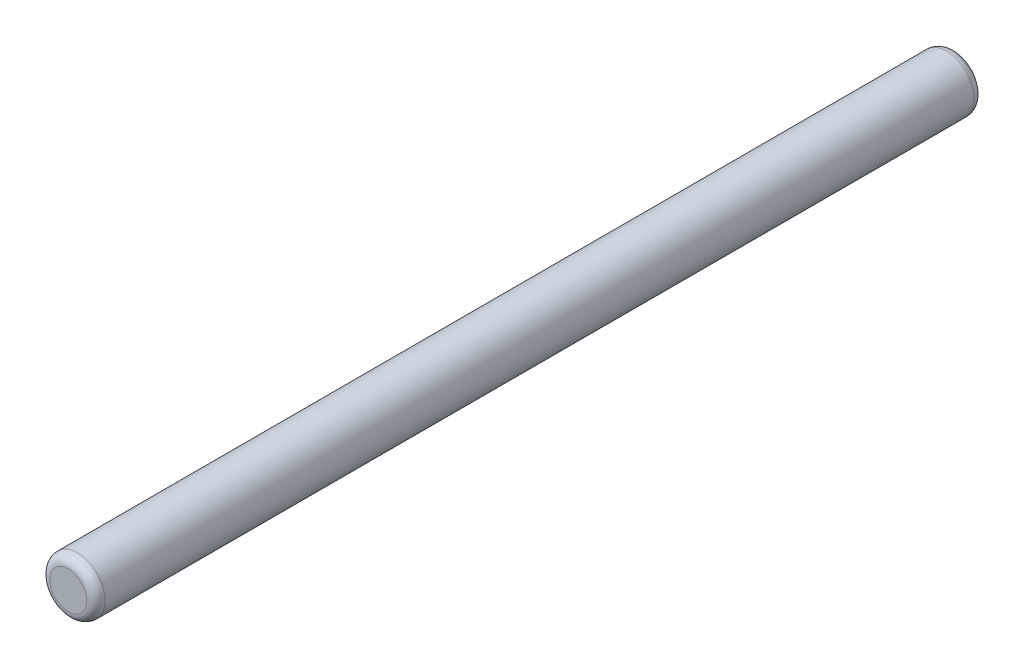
from build123d import *

# Parameters (mm, degrees)
ESQUISSE1_R      = 1.5
EXTRUSION1_DEPTH = 48
CONG_1_R         = 0.5


with BuildPart() as part:
    # Esquisse1 → Extrusion1 (new body)
    with BuildSketch(Plane.XY):
        Circle(ESQUISSE1_R)
    extrude(amount=EXTRUSION1_DEPTH)

    # Cong_1
    cong_1_edges = [part.edges().sort_by_distance(p)[0] for p in [
        (-1.5, 0, 0),
        (-1.5, 0, 48),
    ]]
    fillet(cong_1_edges, radius=CONG_1_R)


solid = part.part
